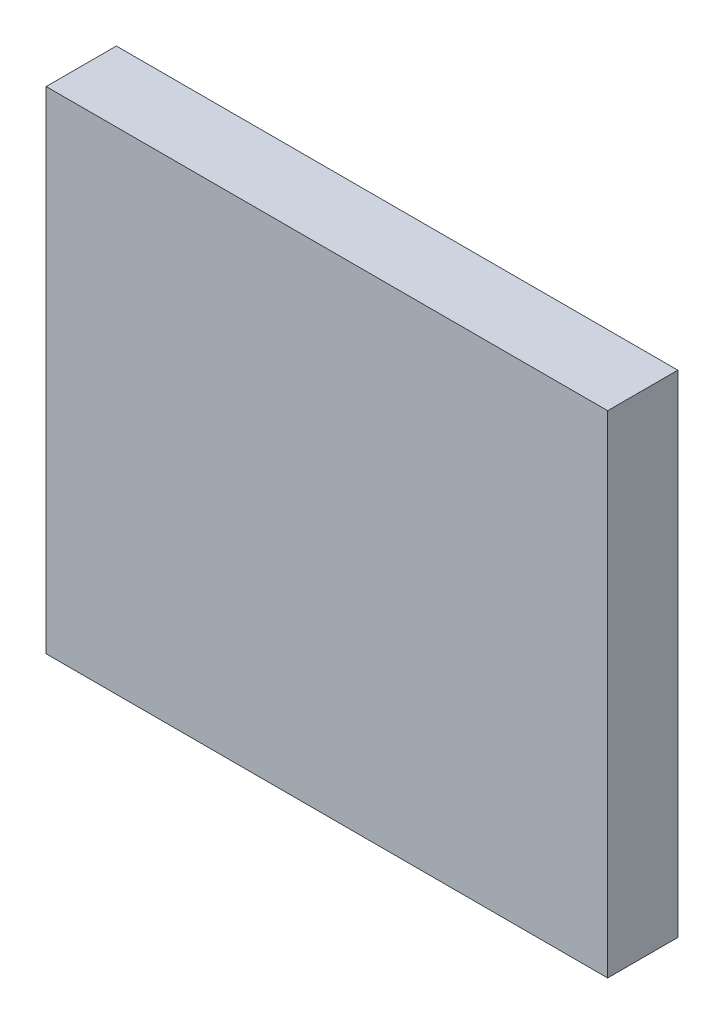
from build123d import *

# Parameters (mm, degrees)
SKETCH1_W           = 16
SKETCH1_H           = 14
BOSS_EXTRUDE1_DEPTH = 2


with BuildPart() as part:
    # Sketch1 → Boss-Extrude1 (new body)
    with BuildSketch(Plane.XY):
        Rectangle(SKETCH1_W, SKETCH1_H)
    extrude(amount=BOSS_EXTRUDE1_DEPTH)


solid = part.part
